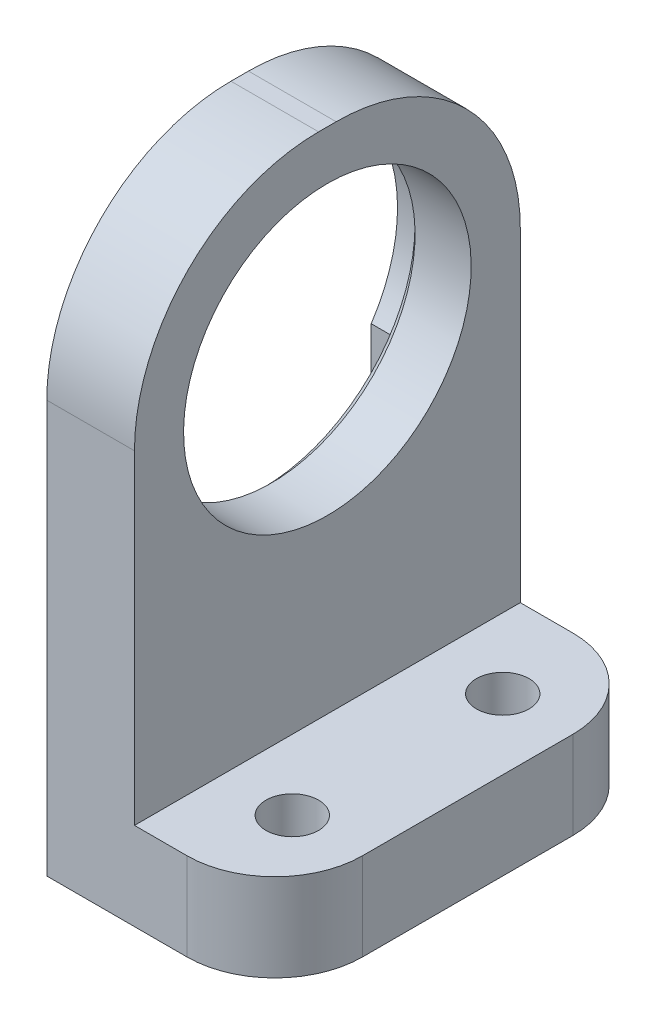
ISO-10303-21;
HEADER;
FILE_DESCRIPTION(('STEP AP214'),'2;1');
FILE_NAME('part.step','',(''),(''),'','','');
FILE_SCHEMA(('AUTOMOTIVE_DESIGN { 1 0 10303 214 1 1 1 1 }'));
ENDSEC;
DATA;
#1=APPLICATION_CONTEXT('core data for automotive mechanical design processes');
#2=APPLICATION_PROTOCOL_DEFINITION('international standard','automotive_design',2000,#1);
#3=PRODUCT_CONTEXT('',#1,'mechanical');
#4=PRODUCT('Part','Part','',(#3));
#5=PRODUCT_RELATED_PRODUCT_CATEGORY('part','',(#4));
#6=PRODUCT_DEFINITION_FORMATION('','',#4);
#7=PRODUCT_DEFINITION_CONTEXT('part definition',#1,'design');
#8=PRODUCT_DEFINITION('design','',#6,#7);
#9=PRODUCT_DEFINITION_SHAPE('','',#8);
#10=(LENGTH_UNIT() NAMED_UNIT(*) SI_UNIT(.MILLI.,.METRE.));
#11=(NAMED_UNIT(*) PLANE_ANGLE_UNIT() SI_UNIT($,.RADIAN.));
#12=(NAMED_UNIT(*) SI_UNIT($,.STERADIAN.) SOLID_ANGLE_UNIT());
#13=UNCERTAINTY_MEASURE_WITH_UNIT(LENGTH_MEASURE(1.E-05),#10,'distance_accuracy_value','');
#14=(GEOMETRIC_REPRESENTATION_CONTEXT(3) GLOBAL_UNCERTAINTY_ASSIGNED_CONTEXT((#13)) GLOBAL_UNIT_ASSIGNED_CONTEXT((#10,
#11,#12)) REPRESENTATION_CONTEXT('',''));
#15=CARTESIAN_POINT('',(0.,0.,0.));
#16=DIRECTION('',(0.,0.,1.));
#17=DIRECTION('',(1.,0.,0.));
#18=AXIS2_PLACEMENT_3D('',#15,#16,#17);
#19=CARTESIAN_POINT('',(0.,23.,11.));
#20=DIRECTION('',(1.,0.,0.));
#21=DIRECTION('',(0.,1.,0.));
#22=AXIS2_PLACEMENT_3D('',#19,#20,#21);
#23=CYLINDRICAL_SURFACE('',#22,8.2);
#24=CARTESIAN_POINT('',(1.8,23.,11.));
#25=DIRECTION('',(-1.,0.,0.));
#26=DIRECTION('',(0.,0.,1.));
#27=AXIS2_PLACEMENT_3D('',#24,#25,#26);
#28=CIRCLE('',#27,8.2);
#29=CARTESIAN_POINT('',(1.8,23.,19.2));
#30=VERTEX_POINT('',#29);
#31=EDGE_CURVE('E11',#30,#30,#28,.T.);
#32=ORIENTED_EDGE('',*,*,#31,.T.);
#33=EDGE_LOOP('',(#32));
#34=FACE_BOUND('',#33,.T.);
#35=CARTESIAN_POINT('',(5.,23.,11.));
#36=DIRECTION('',(1.,0.,0.));
#37=DIRECTION('',(0.,1.,0.));
#38=AXIS2_PLACEMENT_3D('',#35,#36,#37);
#39=CIRCLE('',#38,8.2);
#40=CARTESIAN_POINT('',(5.,31.2,11.));
#41=VERTEX_POINT('',#40);
#42=EDGE_CURVE('E179',#41,#41,#39,.T.);
#43=ORIENTED_EDGE('',*,*,#42,.T.);
#44=EDGE_LOOP('',(#43));
#45=FACE_BOUND('',#44,.T.);
#46=ADVANCED_FACE('F33',(#34,#45),#23,.F.);
#47=CARTESIAN_POINT('',(13.,0.,22.));
#48=DIRECTION('',(0.,1.,0.));
#49=DIRECTION('',(0.,0.,1.));
#50=AXIS2_PLACEMENT_3D('',#47,#48,#49);
#51=PLANE('',#50);
#52=CARTESIAN_POINT('',(9.,0.,17.));
#53=DIRECTION('',(0.,1.,0.));
#54=DIRECTION('',(-1.,0.,0.));
#55=AXIS2_PLACEMENT_3D('',#52,#53,#54);
#56=CIRCLE('',#55,1.5);
#57=CARTESIAN_POINT('',(7.5,0.,17.));
#58=VERTEX_POINT('',#57);
#59=EDGE_CURVE('E371',#58,#58,#56,.T.);
#60=ORIENTED_EDGE('',*,*,#59,.T.);
#61=EDGE_LOOP('',(#60));
#62=FACE_BOUND('',#61,.T.);
#63=CARTESIAN_POINT('',(9.,0.,5.));
#64=DIRECTION('',(0.,1.,0.));
#65=DIRECTION('',(-1.,0.,0.));
#66=AXIS2_PLACEMENT_3D('',#63,#64,#65);
#67=CIRCLE('',#66,1.5);
#68=CARTESIAN_POINT('',(7.5,0.,5.));
#69=VERTEX_POINT('',#68);
#70=EDGE_CURVE('E169',#69,#69,#67,.T.);
#71=ORIENTED_EDGE('',*,*,#70,.T.);
#72=EDGE_LOOP('',(#71));
#73=FACE_BOUND('',#72,.T.);
#74=DIRECTION('',(1.,0.,0.));
#75=VECTOR('',#74,1.);
#76=CARTESIAN_POINT('',(13.,0.,0.));
#77=LINE('',#76,#75);
#78=CARTESIAN_POINT('',(0.,0.,0.));
#79=VERTEX_POINT('',#78);
#80=CARTESIAN_POINT('',(8.,0.,0.));
#81=VERTEX_POINT('',#80);
#82=EDGE_CURVE('E182',#79,#81,#77,.T.);
#83=ORIENTED_EDGE('',*,*,#82,.T.);
#84=CARTESIAN_POINT('',(8.,0.,5.));
#85=DIRECTION('',(0.,1.,0.));
#86=DIRECTION('',(0.,0.,1.));
#87=AXIS2_PLACEMENT_3D('',#84,#85,#86);
#88=CIRCLE('',#87,5.);
#89=CARTESIAN_POINT('',(13.,0.,5.));
#90=VERTEX_POINT('',#89);
#91=EDGE_CURVE('E249',#81,#90,#88,.F.);
#92=ORIENTED_EDGE('',*,*,#91,.T.);
#93=DIRECTION('',(0.,0.,-1.));
#94=VECTOR('',#93,1.);
#95=CARTESIAN_POINT('',(13.,0.,22.));
#96=LINE('',#95,#94);
#97=CARTESIAN_POINT('',(13.,0.,17.));
#98=VERTEX_POINT('',#97);
#99=EDGE_CURVE('E217',#98,#90,#96,.T.);
#100=ORIENTED_EDGE('',*,*,#99,.F.);
#101=CARTESIAN_POINT('',(8.,0.,17.));
#102=DIRECTION('',(0.,1.,0.));
#103=DIRECTION('',(0.,0.,1.));
#104=AXIS2_PLACEMENT_3D('',#101,#102,#103);
#105=CIRCLE('',#104,5.);
#106=CARTESIAN_POINT('',(8.,0.,22.));
#107=VERTEX_POINT('',#106);
#108=EDGE_CURVE('E48',#98,#107,#105,.F.);
#109=ORIENTED_EDGE('',*,*,#108,.T.);
#110=DIRECTION('',(1.,0.,0.));
#111=VECTOR('',#110,1.);
#112=CARTESIAN_POINT('',(13.,0.,22.));
#113=LINE('',#112,#111);
#114=CARTESIAN_POINT('',(0.,0.,22.));
#115=VERTEX_POINT('',#114);
#116=EDGE_CURVE('E183',#115,#107,#113,.T.);
#117=ORIENTED_EDGE('',*,*,#116,.F.);
#118=DIRECTION('',(0.,0.,-1.));
#119=VECTOR('',#118,1.);
#120=CARTESIAN_POINT('',(0.,0.,22.));
#121=LINE('',#120,#119);
#122=CARTESIAN_POINT('',(0.,0.,18.5));
#123=VERTEX_POINT('',#122);
#124=EDGE_CURVE('E202',#115,#123,#121,.T.);
#125=ORIENTED_EDGE('',*,*,#124,.T.);
#126=DIRECTION('',(1.,0.,0.));
#127=VECTOR('',#126,1.);
#128=CARTESIAN_POINT('',(13.,0.,18.5));
#129=LINE('',#128,#127);
#130=CARTESIAN_POINT('',(1.3,0.,18.5));
#131=VERTEX_POINT('',#130);
#132=EDGE_CURVE('E177',#123,#131,#129,.T.);
#133=ORIENTED_EDGE('',*,*,#132,.T.);
#134=DIRECTION('',(0.,0.,1.));
#135=VECTOR('',#134,1.);
#136=CARTESIAN_POINT('',(1.3,0.,22.));
#137=LINE('',#136,#135);
#138=CARTESIAN_POINT('',(1.3,0.,3.5));
#139=VERTEX_POINT('',#138);
#140=EDGE_CURVE('E145',#139,#131,#137,.T.);
#141=ORIENTED_EDGE('',*,*,#140,.F.);
#142=DIRECTION('',(-1.,0.,0.));
#143=VECTOR('',#142,1.);
#144=CARTESIAN_POINT('',(13.,0.,3.5));
#145=LINE('',#144,#143);
#146=CARTESIAN_POINT('',(0.,0.,3.5));
#147=VERTEX_POINT('',#146);
#148=EDGE_CURVE('E174',#139,#147,#145,.T.);
#149=ORIENTED_EDGE('',*,*,#148,.T.);
#150=EDGE_CURVE('E193',#147,#79,#121,.T.);
#151=ORIENTED_EDGE('',*,*,#150,.T.);
#152=EDGE_LOOP('',(#83,#92,#100,#109,#117,#125,#133,#141,#149,#151));
#153=FACE_BOUND('',#152,.T.);
#154=ADVANCED_FACE('F267',(#62,#73,#153),#51,.F.);
#155=CARTESIAN_POINT('',(13.,5.,22.));
#156=DIRECTION('',(-1.,0.,0.));
#157=DIRECTION('',(0.,0.,1.));
#158=AXIS2_PLACEMENT_3D('',#155,#156,#157);
#159=PLANE('',#158);
#160=ORIENTED_EDGE('',*,*,#99,.T.);
#161=DIRECTION('',(0.,1.,0.));
#162=VECTOR('',#161,1.);
#163=CARTESIAN_POINT('',(13.,5.,5.));
#164=LINE('',#163,#162);
#165=CARTESIAN_POINT('',(13.,5.,5.));
#166=VERTEX_POINT('',#165);
#167=EDGE_CURVE('E240',#90,#166,#164,.T.);
#168=ORIENTED_EDGE('',*,*,#167,.T.);
#169=DIRECTION('',(0.,0.,-1.));
#170=VECTOR('',#169,1.);
#171=CARTESIAN_POINT('',(13.,5.,22.));
#172=LINE('',#171,#170);
#173=CARTESIAN_POINT('',(13.,5.,17.));
#174=VERTEX_POINT('',#173);
#175=EDGE_CURVE('E214',#174,#166,#172,.T.);
#176=ORIENTED_EDGE('',*,*,#175,.F.);
#177=DIRECTION('',(0.,1.,0.));
#178=VECTOR('',#177,1.);
#179=CARTESIAN_POINT('',(13.,5.,17.));
#180=LINE('',#179,#178);
#181=EDGE_CURVE('E238',#174,#98,#180,.F.);
#182=ORIENTED_EDGE('',*,*,#181,.T.);
#183=EDGE_LOOP('',(#160,#168,#176,#182));
#184=FACE_BOUND('',#183,.T.);
#185=ADVANCED_FACE('F273',(#184),#159,.F.);
#186=CARTESIAN_POINT('',(5.,5.,22.));
#187=DIRECTION('',(0.,-1.,0.));
#188=DIRECTION('',(1.,0.,0.));
#189=AXIS2_PLACEMENT_3D('',#186,#187,#188);
#190=PLANE('',#189);
#191=CARTESIAN_POINT('',(9.,5.,17.));
#192=DIRECTION('',(0.,1.,0.));
#193=DIRECTION('',(-1.,0.,0.));
#194=AXIS2_PLACEMENT_3D('',#191,#192,#193);
#195=CIRCLE('',#194,1.5);
#196=CARTESIAN_POINT('',(7.5,5.,17.));
#197=VERTEX_POINT('',#196);
#198=EDGE_CURVE('E374',#197,#197,#195,.T.);
#199=ORIENTED_EDGE('',*,*,#198,.F.);
#200=EDGE_LOOP('',(#199));
#201=FACE_BOUND('',#200,.T.);
#202=CARTESIAN_POINT('',(9.,5.,5.));
#203=DIRECTION('',(0.,1.,0.));
#204=DIRECTION('',(-1.,0.,0.));
#205=AXIS2_PLACEMENT_3D('',#202,#203,#204);
#206=CIRCLE('',#205,1.5);
#207=CARTESIAN_POINT('',(7.5,5.,5.));
#208=VERTEX_POINT('',#207);
#209=EDGE_CURVE('E369',#208,#208,#206,.T.);
#210=ORIENTED_EDGE('',*,*,#209,.F.);
#211=EDGE_LOOP('',(#210));
#212=FACE_BOUND('',#211,.T.);
#213=ORIENTED_EDGE('',*,*,#175,.T.);
#214=CARTESIAN_POINT('',(8.,5.,5.));
#215=DIRECTION('',(0.,-1.,0.));
#216=DIRECTION('',(1.,0.,0.));
#217=AXIS2_PLACEMENT_3D('',#214,#215,#216);
#218=CIRCLE('',#217,5.);
#219=CARTESIAN_POINT('',(8.,5.,0.));
#220=VERTEX_POINT('',#219);
#221=EDGE_CURVE('E245',#166,#220,#218,.F.);
#222=ORIENTED_EDGE('',*,*,#221,.T.);
#223=DIRECTION('',(-1.,0.,0.));
#224=VECTOR('',#223,1.);
#225=CARTESIAN_POINT('',(5.,5.,0.));
#226=LINE('',#225,#224);
#227=CARTESIAN_POINT('',(5.,5.,0.));
#228=VERTEX_POINT('',#227);
#229=EDGE_CURVE('E195',#220,#228,#226,.T.);
#230=ORIENTED_EDGE('',*,*,#229,.T.);
#231=DIRECTION('',(0.,0.,-1.));
#232=VECTOR('',#231,1.);
#233=CARTESIAN_POINT('',(5.,5.,22.));
#234=LINE('',#233,#232);
#235=CARTESIAN_POINT('',(5.,5.,22.));
#236=VERTEX_POINT('',#235);
#237=EDGE_CURVE('E211',#236,#228,#234,.T.);
#238=ORIENTED_EDGE('',*,*,#237,.F.);
#239=DIRECTION('',(-1.,0.,0.));
#240=VECTOR('',#239,1.);
#241=CARTESIAN_POINT('',(5.,5.,22.));
#242=LINE('',#241,#240);
#243=CARTESIAN_POINT('',(8.,5.,22.));
#244=VERTEX_POINT('',#243);
#245=EDGE_CURVE('E185',#244,#236,#242,.T.);
#246=ORIENTED_EDGE('',*,*,#245,.F.);
#247=CARTESIAN_POINT('',(8.,5.,17.));
#248=DIRECTION('',(0.,-1.,0.));
#249=DIRECTION('',(1.,0.,0.));
#250=AXIS2_PLACEMENT_3D('',#247,#248,#249);
#251=CIRCLE('',#250,5.);
#252=EDGE_CURVE('E243',#244,#174,#251,.F.);
#253=ORIENTED_EDGE('',*,*,#252,.T.);
#254=EDGE_LOOP('',(#213,#222,#230,#238,#246,#253));
#255=FACE_BOUND('',#254,.T.);
#256=ADVANCED_FACE('F299',(#201,#212,#255),#190,.F.);
#257=CARTESIAN_POINT('',(5.,34.,22.));
#258=DIRECTION('',(-1.,0.,0.));
#259=DIRECTION('',(0.,-1.,0.));
#260=AXIS2_PLACEMENT_3D('',#257,#258,#259);
#261=PLANE('',#260);
#262=ORIENTED_EDGE('',*,*,#42,.F.);
#263=EDGE_LOOP('',(#262));
#264=FACE_BOUND('',#263,.T.);
#265=DIRECTION('',(0.,1.,0.));
#266=VECTOR('',#265,1.);
#267=CARTESIAN_POINT('',(5.,34.,0.));
#268=LINE('',#267,#266);
#269=CARTESIAN_POINT('',(5.,23.5,0.));
#270=VERTEX_POINT('',#269);
#271=EDGE_CURVE('E197',#228,#270,#268,.T.);
#272=ORIENTED_EDGE('',*,*,#271,.T.);
#273=CARTESIAN_POINT('',(5.,23.5,10.5));
#274=DIRECTION('',(-1.,0.,0.));
#275=DIRECTION('',(0.,-1.,0.));
#276=AXIS2_PLACEMENT_3D('',#273,#274,#275);
#277=CIRCLE('',#276,10.5);
#278=CARTESIAN_POINT('',(5.,34.,10.5));
#279=VERTEX_POINT('',#278);
#280=EDGE_CURVE('E233',#270,#279,#277,.F.);
#281=ORIENTED_EDGE('',*,*,#280,.T.);
#282=DIRECTION('',(0.,0.,-1.));
#283=VECTOR('',#282,1.);
#284=CARTESIAN_POINT('',(5.,34.,22.));
#285=LINE('',#284,#283);
#286=CARTESIAN_POINT('',(5.,34.,11.5));
#287=VERTEX_POINT('',#286);
#288=EDGE_CURVE('E208',#287,#279,#285,.T.);
#289=ORIENTED_EDGE('',*,*,#288,.F.);
#290=CARTESIAN_POINT('',(5.,23.5,11.5));
#291=DIRECTION('',(-1.,0.,0.));
#292=DIRECTION('',(0.,-1.,0.));
#293=AXIS2_PLACEMENT_3D('',#290,#291,#292);
#294=CIRCLE('',#293,10.5);
#295=CARTESIAN_POINT('',(5.,23.5,22.));
#296=VERTEX_POINT('',#295);
#297=EDGE_CURVE('E231',#287,#296,#294,.F.);
#298=ORIENTED_EDGE('',*,*,#297,.T.);
#299=DIRECTION('',(0.,1.,0.));
#300=VECTOR('',#299,1.);
#301=CARTESIAN_POINT('',(5.,34.,22.));
#302=LINE('',#301,#300);
#303=EDGE_CURVE('E188',#236,#296,#302,.T.);
#304=ORIENTED_EDGE('',*,*,#303,.F.);
#305=ORIENTED_EDGE('',*,*,#237,.T.);
#306=EDGE_LOOP('',(#272,#281,#289,#298,#304,#305));
#307=FACE_BOUND('',#306,.T.);
#308=ADVANCED_FACE('F295',(#264,#307),#261,.F.);
#309=CARTESIAN_POINT('',(0.,34.,22.));
#310=DIRECTION('',(0.,-1.,0.));
#311=DIRECTION('',(0.,0.,-1.));
#312=AXIS2_PLACEMENT_3D('',#309,#310,#311);
#313=PLANE('',#312);
#314=ORIENTED_EDGE('',*,*,#288,.T.);
#315=DIRECTION('',(-1.,0.,0.));
#316=VECTOR('',#315,1.);
#317=CARTESIAN_POINT('',(0.,34.,10.5));
#318=LINE('',#317,#316);
#319=CARTESIAN_POINT('',(0.,34.,10.5));
#320=VERTEX_POINT('',#319);
#321=EDGE_CURVE('E222',#279,#320,#318,.T.);
#322=ORIENTED_EDGE('',*,*,#321,.T.);
#323=DIRECTION('',(0.,0.,-1.));
#324=VECTOR('',#323,1.);
#325=CARTESIAN_POINT('',(0.,34.,22.));
#326=LINE('',#325,#324);
#327=CARTESIAN_POINT('',(0.,34.,11.5));
#328=VERTEX_POINT('',#327);
#329=EDGE_CURVE('E205',#328,#320,#326,.T.);
#330=ORIENTED_EDGE('',*,*,#329,.F.);
#331=DIRECTION('',(-1.,0.,0.));
#332=VECTOR('',#331,1.);
#333=CARTESIAN_POINT('',(0.,34.,11.5));
#334=LINE('',#333,#332);
#335=EDGE_CURVE('E220',#328,#287,#334,.F.);
#336=ORIENTED_EDGE('',*,*,#335,.T.);
#337=EDGE_LOOP('',(#314,#322,#330,#336));
#338=FACE_BOUND('',#337,.T.);
#339=ADVANCED_FACE('F291',(#338),#313,.F.);
#340=CARTESIAN_POINT('',(0.,0.,22.));
#341=DIRECTION('',(1.,0.,0.));
#342=DIRECTION('',(0.,0.,-1.));
#343=AXIS2_PLACEMENT_3D('',#340,#341,#342);
#344=PLANE('',#343);
#345=CARTESIAN_POINT('',(0.,23.,11.));
#346=DIRECTION('',(-1.,0.,0.));
#347=DIRECTION('',(0.,0.,1.));
#348=AXIS2_PLACEMENT_3D('',#345,#346,#347);
#349=CIRCLE('',#348,9.);
#350=CARTESIAN_POINT('',(0.,18.0250628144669,18.5));
#351=VERTEX_POINT('',#350);
#352=CARTESIAN_POINT('',(0.,18.0250628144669,3.5));
#353=VERTEX_POINT('',#352);
#354=EDGE_CURVE('E168',#351,#353,#349,.T.);
#355=ORIENTED_EDGE('',*,*,#354,.F.);
#356=DIRECTION('',(0.,1.,0.));
#357=VECTOR('',#356,1.);
#358=CARTESIAN_POINT('',(0.,18.0250628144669,18.5));
#359=LINE('',#358,#357);
#360=EDGE_CURVE('E154',#123,#351,#359,.T.);
#361=ORIENTED_EDGE('',*,*,#360,.F.);
#362=ORIENTED_EDGE('',*,*,#124,.F.);
#363=DIRECTION('',(0.,-1.,0.));
#364=VECTOR('',#363,1.);
#365=CARTESIAN_POINT('',(0.,0.,22.));
#366=LINE('',#365,#364);
#367=CARTESIAN_POINT('',(0.,23.5,22.));
#368=VERTEX_POINT('',#367);
#369=EDGE_CURVE('E191',#368,#115,#366,.T.);
#370=ORIENTED_EDGE('',*,*,#369,.F.);
#371=CARTESIAN_POINT('',(0.,23.5,11.5));
#372=DIRECTION('',(1.,0.,0.));
#373=DIRECTION('',(0.,0.,-1.));
#374=AXIS2_PLACEMENT_3D('',#371,#372,#373);
#375=CIRCLE('',#374,10.5);
#376=EDGE_CURVE('E225',#368,#328,#375,.F.);
#377=ORIENTED_EDGE('',*,*,#376,.T.);
#378=ORIENTED_EDGE('',*,*,#329,.T.);
#379=CARTESIAN_POINT('',(0.,23.5,10.5));
#380=DIRECTION('',(1.,0.,0.));
#381=DIRECTION('',(0.,0.,-1.));
#382=AXIS2_PLACEMENT_3D('',#379,#380,#381);
#383=CIRCLE('',#382,10.5);
#384=CARTESIAN_POINT('',(0.,23.5,0.));
#385=VERTEX_POINT('',#384);
#386=EDGE_CURVE('E227',#320,#385,#383,.F.);
#387=ORIENTED_EDGE('',*,*,#386,.T.);
#388=DIRECTION('',(0.,-1.,0.));
#389=VECTOR('',#388,1.);
#390=CARTESIAN_POINT('',(0.,0.,0.));
#391=LINE('',#390,#389);
#392=EDGE_CURVE('E186',#385,#79,#391,.T.);
#393=ORIENTED_EDGE('',*,*,#392,.T.);
#394=ORIENTED_EDGE('',*,*,#150,.F.);
#395=DIRECTION('',(0.,-1.,0.));
#396=VECTOR('',#395,1.);
#397=CARTESIAN_POINT('',(0.,18.0250628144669,3.5));
#398=LINE('',#397,#396);
#399=EDGE_CURVE('E148',#353,#147,#398,.T.);
#400=ORIENTED_EDGE('',*,*,#399,.F.);
#401=EDGE_LOOP('',(#355,#361,#362,#370,#377,#378,#387,#393,#394,#400));
#402=FACE_BOUND('',#401,.T.);
#403=ADVANCED_FACE('F284',(#402),#344,.F.);
#404=CARTESIAN_POINT('',(0.,0.,22.));
#405=DIRECTION('',(0.,0.,-1.));
#406=DIRECTION('',(-1.,0.,0.));
#407=AXIS2_PLACEMENT_3D('',#404,#405,#406);
#408=PLANE('',#407);
#409=ORIENTED_EDGE('',*,*,#116,.T.);
#410=DIRECTION('',(0.,1.,0.));
#411=VECTOR('',#410,1.);
#412=CARTESIAN_POINT('',(8.,0.,22.));
#413=LINE('',#412,#411);
#414=EDGE_CURVE('E251',#107,#244,#413,.T.);
#415=ORIENTED_EDGE('',*,*,#414,.T.);
#416=ORIENTED_EDGE('',*,*,#245,.T.);
#417=ORIENTED_EDGE('',*,*,#303,.T.);
#418=DIRECTION('',(-1.,0.,0.));
#419=VECTOR('',#418,1.);
#420=CARTESIAN_POINT('',(0.,23.5,22.));
#421=LINE('',#420,#419);
#422=EDGE_CURVE('E235',#296,#368,#421,.T.);
#423=ORIENTED_EDGE('',*,*,#422,.T.);
#424=ORIENTED_EDGE('',*,*,#369,.T.);
#425=EDGE_LOOP('',(#409,#415,#416,#417,#423,#424));
#426=FACE_BOUND('',#425,.T.);
#427=ADVANCED_FACE('F280',(#426),#408,.F.);
#428=CARTESIAN_POINT('',(0.,0.,0.));
#429=DIRECTION('',(0.,0.,-1.));
#430=DIRECTION('',(-1.,0.,0.));
#431=AXIS2_PLACEMENT_3D('',#428,#429,#430);
#432=PLANE('',#431);
#433=ORIENTED_EDGE('',*,*,#229,.F.);
#434=DIRECTION('',(0.,1.,0.));
#435=VECTOR('',#434,1.);
#436=CARTESIAN_POINT('',(8.,0.,0.));
#437=LINE('',#436,#435);
#438=EDGE_CURVE('E56',#220,#81,#437,.F.);
#439=ORIENTED_EDGE('',*,*,#438,.T.);
#440=ORIENTED_EDGE('',*,*,#82,.F.);
#441=ORIENTED_EDGE('',*,*,#392,.F.);
#442=DIRECTION('',(-1.,0.,0.));
#443=VECTOR('',#442,1.);
#444=CARTESIAN_POINT('',(5.,23.5,0.));
#445=LINE('',#444,#443);
#446=EDGE_CURVE('E229',#385,#270,#445,.F.);
#447=ORIENTED_EDGE('',*,*,#446,.T.);
#448=ORIENTED_EDGE('',*,*,#271,.F.);
#449=EDGE_LOOP('',(#433,#439,#440,#441,#447,#448));
#450=FACE_BOUND('',#449,.T.);
#451=ADVANCED_FACE('F283',(#450),#432,.T.);
#452=CARTESIAN_POINT('',(0.,23.5,10.5));
#453=DIRECTION('',(1.,0.,0.));
#454=DIRECTION('',(0.,0.,-1.));
#455=AXIS2_PLACEMENT_3D('',#452,#453,#454);
#456=CYLINDRICAL_SURFACE('',#455,10.5);
#457=ORIENTED_EDGE('',*,*,#280,.F.);
#458=ORIENTED_EDGE('',*,*,#446,.F.);
#459=ORIENTED_EDGE('',*,*,#386,.F.);
#460=ORIENTED_EDGE('',*,*,#321,.F.);
#461=EDGE_LOOP('',(#457,#458,#459,#460));
#462=FACE_BOUND('',#461,.T.);
#463=ADVANCED_FACE('F288',(#462),#456,.T.);
#464=CARTESIAN_POINT('',(0.,23.5,11.5));
#465=DIRECTION('',(-1.,0.,0.));
#466=DIRECTION('',(0.,0.,1.));
#467=AXIS2_PLACEMENT_3D('',#464,#465,#466);
#468=CYLINDRICAL_SURFACE('',#467,10.5);
#469=ORIENTED_EDGE('',*,*,#297,.F.);
#470=ORIENTED_EDGE('',*,*,#335,.F.);
#471=ORIENTED_EDGE('',*,*,#376,.F.);
#472=ORIENTED_EDGE('',*,*,#422,.F.);
#473=EDGE_LOOP('',(#469,#470,#471,#472));
#474=FACE_BOUND('',#473,.T.);
#475=ADVANCED_FACE('F309',(#474),#468,.T.);
#476=CARTESIAN_POINT('',(1.3,18.0250628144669,18.5));
#477=DIRECTION('',(0.,0.,1.));
#478=DIRECTION('',(1.,0.,0.));
#479=AXIS2_PLACEMENT_3D('',#476,#477,#478);
#480=PLANE('',#479);
#481=ORIENTED_EDGE('',*,*,#360,.T.);
#482=DIRECTION('',(-1.,0.,0.));
#483=VECTOR('',#482,1.);
#484=CARTESIAN_POINT('',(1.3,18.0250628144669,18.5));
#485=LINE('',#484,#483);
#486=CARTESIAN_POINT('',(1.3,18.0250628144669,18.5));
#487=VERTEX_POINT('',#486);
#488=EDGE_CURVE('E151',#487,#351,#485,.T.);
#489=ORIENTED_EDGE('',*,*,#488,.F.);
#490=DIRECTION('',(0.,1.,0.));
#491=VECTOR('',#490,1.);
#492=CARTESIAN_POINT('',(1.3,18.0250628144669,18.5));
#493=LINE('',#492,#491);
#494=EDGE_CURVE('E138',#131,#487,#493,.T.);
#495=ORIENTED_EDGE('',*,*,#494,.F.);
#496=ORIENTED_EDGE('',*,*,#132,.F.);
#497=EDGE_LOOP('',(#481,#489,#495,#496));
#498=FACE_BOUND('',#497,.T.);
#499=ADVANCED_FACE('F152',(#498),#480,.F.);
#500=CARTESIAN_POINT('',(1.3,18.0250628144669,3.5));
#501=DIRECTION('',(0.,0.,-1.));
#502=DIRECTION('',(0.,1.,0.));
#503=AXIS2_PLACEMENT_3D('',#500,#501,#502);
#504=PLANE('',#503);
#505=DIRECTION('',(0.,-1.,0.));
#506=VECTOR('',#505,1.);
#507=CARTESIAN_POINT('',(1.3,18.0250628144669,3.5));
#508=LINE('',#507,#506);
#509=CARTESIAN_POINT('',(1.3,18.0250628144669,3.5));
#510=VERTEX_POINT('',#509);
#511=EDGE_CURVE('E159',#510,#139,#508,.T.);
#512=ORIENTED_EDGE('',*,*,#511,.F.);
#513=DIRECTION('',(-1.,0.,0.));
#514=VECTOR('',#513,1.);
#515=CARTESIAN_POINT('',(1.3,18.0250628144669,3.5));
#516=LINE('',#515,#514);
#517=EDGE_CURVE('E158',#510,#353,#516,.T.);
#518=ORIENTED_EDGE('',*,*,#517,.T.);
#519=ORIENTED_EDGE('',*,*,#399,.T.);
#520=ORIENTED_EDGE('',*,*,#148,.F.);
#521=EDGE_LOOP('',(#512,#518,#519,#520));
#522=FACE_BOUND('',#521,.T.);
#523=ADVANCED_FACE('F348',(#522),#504,.F.);
#524=CARTESIAN_POINT('',(1.3,23.,11.));
#525=DIRECTION('',(-1.,0.,0.));
#526=DIRECTION('',(0.,0.,1.));
#527=AXIS2_PLACEMENT_3D('',#524,#525,#526);
#528=PLANE('',#527);
#529=CARTESIAN_POINT('',(1.3,23.,11.));
#530=DIRECTION('',(-1.,0.,0.));
#531=DIRECTION('',(0.,0.,1.));
#532=AXIS2_PLACEMENT_3D('',#529,#530,#531);
#533=CIRCLE('',#532,8.7);
#534=CARTESIAN_POINT('',(1.3,23.,19.7));
#535=VERTEX_POINT('',#534);
#536=EDGE_CURVE('E41',#535,#535,#533,.F.);
#537=ORIENTED_EDGE('',*,*,#536,.T.);
#538=EDGE_LOOP('',(#537));
#539=FACE_BOUND('',#538,.T.);
#540=ORIENTED_EDGE('',*,*,#140,.T.);
#541=ORIENTED_EDGE('',*,*,#494,.T.);
#542=CARTESIAN_POINT('',(1.3,23.,11.));
#543=DIRECTION('',(-1.,0.,0.));
#544=DIRECTION('',(0.,0.,1.));
#545=AXIS2_PLACEMENT_3D('',#542,#543,#544);
#546=CIRCLE('',#545,9.);
#547=EDGE_CURVE('E143',#487,#510,#546,.T.);
#548=ORIENTED_EDGE('',*,*,#547,.T.);
#549=ORIENTED_EDGE('',*,*,#511,.T.);
#550=EDGE_LOOP('',(#540,#541,#548,#549));
#551=FACE_BOUND('',#550,.T.);
#552=ADVANCED_FACE('F140',(#539,#551),#528,.T.);
#553=CARTESIAN_POINT('',(1.3,23.,11.));
#554=DIRECTION('',(-1.,0.,0.));
#555=DIRECTION('',(0.,0.,1.));
#556=AXIS2_PLACEMENT_3D('',#553,#554,#555);
#557=CYLINDRICAL_SURFACE('',#556,9.);
#558=ORIENTED_EDGE('',*,*,#354,.T.);
#559=ORIENTED_EDGE('',*,*,#517,.F.);
#560=ORIENTED_EDGE('',*,*,#547,.F.);
#561=ORIENTED_EDGE('',*,*,#488,.T.);
#562=EDGE_LOOP('',(#558,#559,#560,#561));
#563=FACE_BOUND('',#562,.T.);
#564=ADVANCED_FACE('F161',(#563),#557,.F.);
#565=CARTESIAN_POINT('',(9.,0.,5.));
#566=DIRECTION('',(0.,1.,0.));
#567=DIRECTION('',(-1.,0.,0.));
#568=AXIS2_PLACEMENT_3D('',#565,#566,#567);
#569=CYLINDRICAL_SURFACE('',#568,1.5);
#570=ORIENTED_EDGE('',*,*,#70,.F.);
#571=EDGE_LOOP('',(#570));
#572=FACE_BOUND('',#571,.T.);
#573=ORIENTED_EDGE('',*,*,#209,.T.);
#574=EDGE_LOOP('',(#573));
#575=FACE_BOUND('',#574,.T.);
#576=ADVANCED_FACE('F320',(#572,#575),#569,.F.);
#577=CARTESIAN_POINT('',(9.,0.,17.));
#578=DIRECTION('',(0.,1.,0.));
#579=DIRECTION('',(-1.,0.,0.));
#580=AXIS2_PLACEMENT_3D('',#577,#578,#579);
#581=CYLINDRICAL_SURFACE('',#580,1.5);
#582=ORIENTED_EDGE('',*,*,#59,.F.);
#583=EDGE_LOOP('',(#582));
#584=FACE_BOUND('',#583,.T.);
#585=ORIENTED_EDGE('',*,*,#198,.T.);
#586=EDGE_LOOP('',(#585));
#587=FACE_BOUND('',#586,.T.);
#588=ADVANCED_FACE('F315',(#584,#587),#581,.F.);
#589=CARTESIAN_POINT('',(8.,5.,5.));
#590=DIRECTION('',(0.,-1.,0.));
#591=DIRECTION('',(0.,0.,-1.));
#592=AXIS2_PLACEMENT_3D('',#589,#590,#591);
#593=CYLINDRICAL_SURFACE('',#592,5.);
#594=ORIENTED_EDGE('',*,*,#91,.F.);
#595=ORIENTED_EDGE('',*,*,#438,.F.);
#596=ORIENTED_EDGE('',*,*,#221,.F.);
#597=ORIENTED_EDGE('',*,*,#167,.F.);
#598=EDGE_LOOP('',(#594,#595,#596,#597));
#599=FACE_BOUND('',#598,.T.);
#600=ADVANCED_FACE('F263',(#599),#593,.T.);
#601=CARTESIAN_POINT('',(8.,0.,17.));
#602=DIRECTION('',(0.,1.,0.));
#603=DIRECTION('',(0.,0.,1.));
#604=AXIS2_PLACEMENT_3D('',#601,#602,#603);
#605=CYLINDRICAL_SURFACE('',#604,5.);
#606=ORIENTED_EDGE('',*,*,#108,.F.);
#607=ORIENTED_EDGE('',*,*,#181,.F.);
#608=ORIENTED_EDGE('',*,*,#252,.F.);
#609=ORIENTED_EDGE('',*,*,#414,.F.);
#610=EDGE_LOOP('',(#606,#607,#608,#609));
#611=FACE_BOUND('',#610,.T.);
#612=ADVANCED_FACE('F258',(#611),#605,.T.);
#613=CARTESIAN_POINT('',(1.3,23.,11.));
#614=DIRECTION('',(-1.,0.,0.));
#615=DIRECTION('',(0.,0.,1.));
#616=AXIS2_PLACEMENT_3D('',#613,#614,#615);
#617=CONICAL_SURFACE('',#616,8.7,0.785398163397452);
#618=ORIENTED_EDGE('',*,*,#31,.F.);
#619=EDGE_LOOP('',(#618));
#620=FACE_BOUND('',#619,.T.);
#621=ORIENTED_EDGE('',*,*,#536,.F.);
#622=EDGE_LOOP('',(#621));
#623=FACE_BOUND('',#622,.T.);
#624=ADVANCED_FACE('F35',(#620,#623),#617,.F.);
#625=CLOSED_SHELL('',(#46,#154,#185,#256,#308,#339,#403,#427,#451,#463,#475,#499,#523,#552,#564,
#576,#588,#600,#612,#624));
#626=MANIFOLD_SOLID_BREP('B2',#625);
#627=ADVANCED_BREP_SHAPE_REPRESENTATION('',(#18,#626),#14);
#628=SHAPE_DEFINITION_REPRESENTATION(#9,#627);
ENDSEC;
END-ISO-10303-21;
